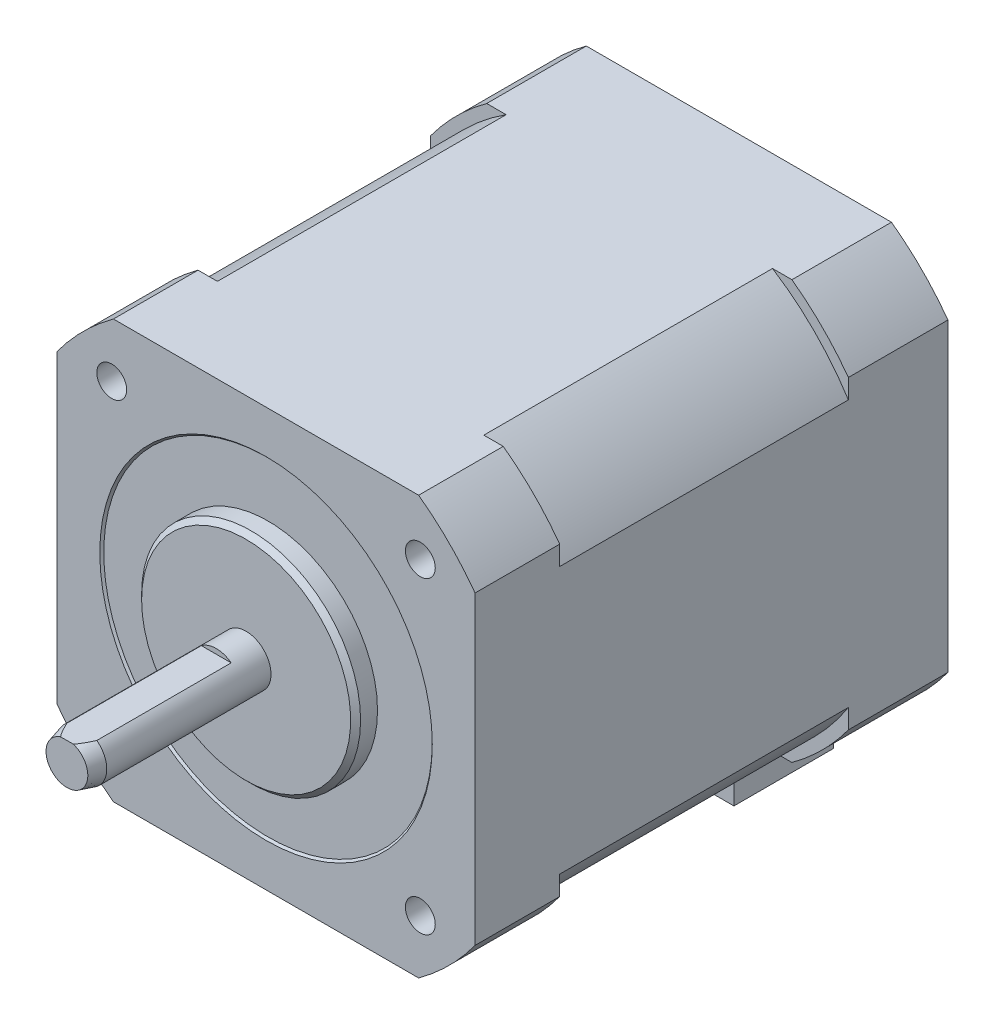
ISO-10303-21;
HEADER;
FILE_DESCRIPTION(('STEP AP214'),'2;1');
FILE_NAME('part.step','',(''),(''),'','','');
FILE_SCHEMA(('AUTOMOTIVE_DESIGN { 1 0 10303 214 1 1 1 1 }'));
ENDSEC;
DATA;
#1=APPLICATION_CONTEXT('core data for automotive mechanical design processes');
#2=APPLICATION_PROTOCOL_DEFINITION('international standard','automotive_design',2000,#1);
#3=PRODUCT_CONTEXT('',#1,'mechanical');
#4=PRODUCT('Part','Part','',(#3));
#5=PRODUCT_RELATED_PRODUCT_CATEGORY('part','',(#4));
#6=PRODUCT_DEFINITION_FORMATION('','',#4);
#7=PRODUCT_DEFINITION_CONTEXT('part definition',#1,'design');
#8=PRODUCT_DEFINITION('design','',#6,#7);
#9=PRODUCT_DEFINITION_SHAPE('','',#8);
#10=(LENGTH_UNIT() NAMED_UNIT(*) SI_UNIT(.MILLI.,.METRE.));
#11=(NAMED_UNIT(*) PLANE_ANGLE_UNIT() SI_UNIT($,.RADIAN.));
#12=(NAMED_UNIT(*) SI_UNIT($,.STERADIAN.) SOLID_ANGLE_UNIT());
#13=UNCERTAINTY_MEASURE_WITH_UNIT(LENGTH_MEASURE(1.E-05),#10,'distance_accuracy_value','');
#14=(GEOMETRIC_REPRESENTATION_CONTEXT(3) GLOBAL_UNCERTAINTY_ASSIGNED_CONTEXT((#13)) GLOBAL_UNIT_ASSIGNED_CONTEXT((#10,
#11,#12)) REPRESENTATION_CONTEXT('',''));
#15=CARTESIAN_POINT('',(0.,0.,0.));
#16=DIRECTION('',(0.,0.,1.));
#17=DIRECTION('',(1.,0.,0.));
#18=AXIS2_PLACEMENT_3D('',#15,#16,#17);
#19=CARTESIAN_POINT('',(21.,-21.,-10.5));
#20=DIRECTION('',(0.,1.,0.));
#21=DIRECTION('',(-1.,0.,0.));
#22=AXIS2_PLACEMENT_3D('',#19,#20,#21);
#23=PLANE('',#22);
#24=DIRECTION('',(0.,0.,-1.));
#25=VECTOR('',#24,1.);
#26=CARTESIAN_POINT('',(-9.5,-21.,-39.5));
#27=LINE('',#26,#25);
#28=CARTESIAN_POINT('',(-9.5,-21.,-39.5));
#29=VERTEX_POINT('',#28);
#30=CARTESIAN_POINT('',(-9.5,-21.0000000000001,-49.5));
#31=VERTEX_POINT('',#30);
#32=EDGE_CURVE('E42',#29,#31,#27,.T.);
#33=ORIENTED_EDGE('',*,*,#32,.F.);
#34=DIRECTION('',(-1.,0.,0.));
#35=VECTOR('',#34,1.);
#36=CARTESIAN_POINT('',(-9.5,-21.,-39.5));
#37=LINE('',#36,#35);
#38=CARTESIAN_POINT('',(9.5,-21.,-39.5));
#39=VERTEX_POINT('',#38);
#40=EDGE_CURVE('E262',#39,#29,#37,.T.);
#41=ORIENTED_EDGE('',*,*,#40,.F.);
#42=DIRECTION('',(0.,0.,1.));
#43=VECTOR('',#42,1.);
#44=CARTESIAN_POINT('',(9.5,-21.,-39.5));
#45=LINE('',#44,#43);
#46=CARTESIAN_POINT('',(9.5,-21.,-49.5));
#47=VERTEX_POINT('',#46);
#48=EDGE_CURVE('E278',#47,#39,#45,.T.);
#49=ORIENTED_EDGE('',*,*,#48,.F.);
#50=DIRECTION('',(-1.,0.,0.));
#51=VECTOR('',#50,1.);
#52=CARTESIAN_POINT('',(15.3297097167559,-21.,-49.5));
#53=LINE('',#52,#51);
#54=CARTESIAN_POINT('',(15.3297097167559,-21.,-49.5));
#55=VERTEX_POINT('',#54);
#56=EDGE_CURVE('E283',#55,#47,#53,.T.);
#57=ORIENTED_EDGE('',*,*,#56,.F.);
#58=DIRECTION('',(0.,0.,1.));
#59=VECTOR('',#58,1.);
#60=CARTESIAN_POINT('',(15.3297097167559,-21.,-49.5));
#61=LINE('',#60,#59);
#62=CARTESIAN_POINT('',(15.3297097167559,-21.,-39.5));
#63=VERTEX_POINT('',#62);
#64=EDGE_CURVE('E356',#55,#63,#61,.T.);
#65=ORIENTED_EDGE('',*,*,#64,.T.);
#66=DIRECTION('',(-1.,0.,0.));
#67=VECTOR('',#66,1.);
#68=CARTESIAN_POINT('',(-13.3794618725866,-21.,-39.5));
#69=LINE('',#68,#67);
#70=CARTESIAN_POINT('',(13.3794618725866,-21.,-39.5));
#71=VERTEX_POINT('',#70);
#72=EDGE_CURVE('E317',#63,#71,#69,.T.);
#73=ORIENTED_EDGE('',*,*,#72,.T.);
#74=DIRECTION('',(0.,0.,1.));
#75=VECTOR('',#74,1.);
#76=CARTESIAN_POINT('',(13.3794618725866,-21.,-39.5));
#77=LINE('',#76,#75);
#78=CARTESIAN_POINT('',(13.3794618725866,-21.,-10.5));
#79=VERTEX_POINT('',#78);
#80=EDGE_CURVE('E724',#71,#79,#77,.T.);
#81=ORIENTED_EDGE('',*,*,#80,.T.);
#82=DIRECTION('',(-1.,0.,0.));
#83=VECTOR('',#82,1.);
#84=CARTESIAN_POINT('',(21.,-21.,-10.5));
#85=LINE('',#84,#83);
#86=CARTESIAN_POINT('',(15.3297097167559,-21.,-10.5));
#87=VERTEX_POINT('',#86);
#88=EDGE_CURVE('E563',#87,#79,#85,.T.);
#89=ORIENTED_EDGE('',*,*,#88,.F.);
#90=DIRECTION('',(0.,0.,1.));
#91=VECTOR('',#90,1.);
#92=CARTESIAN_POINT('',(15.3297097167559,-21.,-36.));
#93=LINE('',#92,#91);
#94=CARTESIAN_POINT('',(15.3297097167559,-21.,-2.));
#95=VERTEX_POINT('',#94);
#96=EDGE_CURVE('E625',#95,#87,#93,.F.);
#97=ORIENTED_EDGE('',*,*,#96,.F.);
#98=DIRECTION('',(-1.,0.,0.));
#99=VECTOR('',#98,1.);
#100=CARTESIAN_POINT('',(21.,-21.,-2.));
#101=LINE('',#100,#99);
#102=CARTESIAN_POINT('',(-15.3297097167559,-21.,-2.));
#103=VERTEX_POINT('',#102);
#104=EDGE_CURVE('E571',#95,#103,#101,.T.);
#105=ORIENTED_EDGE('',*,*,#104,.T.);
#106=DIRECTION('',(0.,0.,1.));
#107=VECTOR('',#106,1.);
#108=CARTESIAN_POINT('',(-15.3297097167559,-21.,-36.));
#109=LINE('',#108,#107);
#110=CARTESIAN_POINT('',(-15.3297097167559,-21.,-10.5));
#111=VERTEX_POINT('',#110);
#112=EDGE_CURVE('E629',#111,#103,#109,.T.);
#113=ORIENTED_EDGE('',*,*,#112,.F.);
#114=CARTESIAN_POINT('',(-13.3794618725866,-21.,-10.5));
#115=VERTEX_POINT('',#114);
#116=EDGE_CURVE('E568',#115,#111,#85,.T.);
#117=ORIENTED_EDGE('',*,*,#116,.F.);
#118=DIRECTION('',(0.,0.,1.));
#119=VECTOR('',#118,1.);
#120=CARTESIAN_POINT('',(-13.3794618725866,-21.,-39.5));
#121=LINE('',#120,#119);
#122=CARTESIAN_POINT('',(-13.3794618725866,-21.,-39.5));
#123=VERTEX_POINT('',#122);
#124=EDGE_CURVE('E725',#123,#115,#121,.T.);
#125=ORIENTED_EDGE('',*,*,#124,.F.);
#126=CARTESIAN_POINT('',(-15.3297097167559,-21.,-39.5));
#127=VERTEX_POINT('',#126);
#128=EDGE_CURVE('E315',#123,#127,#69,.T.);
#129=ORIENTED_EDGE('',*,*,#128,.T.);
#130=DIRECTION('',(0.,0.,1.));
#131=VECTOR('',#130,1.);
#132=CARTESIAN_POINT('',(-15.3297097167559,-21.,-49.5));
#133=LINE('',#132,#131);
#134=CARTESIAN_POINT('',(-15.3297097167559,-21.,-49.5));
#135=VERTEX_POINT('',#134);
#136=EDGE_CURVE('E353',#135,#127,#133,.T.);
#137=ORIENTED_EDGE('',*,*,#136,.F.);
#138=EDGE_CURVE('E60',#31,#135,#53,.T.);
#139=ORIENTED_EDGE('',*,*,#138,.F.);
#140=EDGE_LOOP('',(#33,#41,#49,#57,#65,#73,#81,#89,#97,#105,#113,#117,#125,#129,#137,#139));
#141=FACE_BOUND('',#140,.T.);
#142=ADVANCED_FACE('F38',(#141),#23,.F.);
#143=CARTESIAN_POINT('',(0.,0.,18.));
#144=DIRECTION('',(0.,0.,-1.));
#145=DIRECTION('',(-1.,0.,0.));
#146=AXIS2_PLACEMENT_3D('',#143,#144,#145);
#147=CYLINDRICAL_SURFACE('',#146,2.5);
#148=CARTESIAN_POINT('',(0.,0.,16.5000000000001));
#149=DIRECTION('',(0.,0.,1.));
#150=DIRECTION('',(1.,0.,0.));
#151=AXIS2_PLACEMENT_3D('',#148,#149,#150);
#152=CIRCLE('',#151,2.5);
#153=CARTESIAN_POINT('',(1.5,2.,16.5000000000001));
#154=VERTEX_POINT('',#153);
#155=CARTESIAN_POINT('',(-1.49999999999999,2.,16.5000000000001));
#156=VERTEX_POINT('',#155);
#157=EDGE_CURVE('E407',#154,#156,#152,.F.);
#158=ORIENTED_EDGE('',*,*,#157,.T.);
#159=DIRECTION('',(0.,0.,-1.));
#160=VECTOR('',#159,1.);
#161=CARTESIAN_POINT('',(-1.5,2.,18.));
#162=LINE('',#161,#160);
#163=CARTESIAN_POINT('',(-1.5,2.,3.));
#164=VERTEX_POINT('',#163);
#165=EDGE_CURVE('E303',#156,#164,#162,.T.);
#166=ORIENTED_EDGE('',*,*,#165,.T.);
#167=CARTESIAN_POINT('',(0.,0.,3.));
#168=DIRECTION('',(0.,0.,1.));
#169=DIRECTION('',(1.,0.,0.));
#170=AXIS2_PLACEMENT_3D('',#167,#168,#169);
#171=CIRCLE('',#170,2.5);
#172=CARTESIAN_POINT('',(1.5,2.,3.));
#173=VERTEX_POINT('',#172);
#174=EDGE_CURVE('E419',#173,#164,#171,.T.);
#175=ORIENTED_EDGE('',*,*,#174,.F.);
#176=DIRECTION('',(0.,0.,-1.));
#177=VECTOR('',#176,1.);
#178=CARTESIAN_POINT('',(1.5,2.,18.));
#179=LINE('',#178,#177);
#180=EDGE_CURVE('E756',#173,#154,#179,.F.);
#181=ORIENTED_EDGE('',*,*,#180,.T.);
#182=EDGE_LOOP('',(#158,#166,#175,#181));
#183=FACE_BOUND('',#182,.T.);
#184=CARTESIAN_POINT('',(0.,0.,0.));
#185=DIRECTION('',(0.,0.,-1.));
#186=DIRECTION('',(-1.,0.,0.));
#187=AXIS2_PLACEMENT_3D('',#184,#185,#186);
#188=CIRCLE('',#187,2.5);
#189=CARTESIAN_POINT('',(-2.5,0.,0.));
#190=VERTEX_POINT('',#189);
#191=EDGE_CURVE('E560',#190,#190,#188,.T.);
#192=ORIENTED_EDGE('',*,*,#191,.F.);
#193=EDGE_LOOP('',(#192));
#194=FACE_BOUND('',#193,.T.);
#195=ADVANCED_FACE('F528',(#183,#194),#147,.T.);
#196=CARTESIAN_POINT('',(0.,0.,18.));
#197=DIRECTION('',(0.,0.,1.));
#198=DIRECTION('',(1.,0.,0.));
#199=AXIS2_PLACEMENT_3D('',#196,#197,#198);
#200=PLANE('',#199);
#201=DIRECTION('',(1.,0.,0.));
#202=VECTOR('',#201,1.);
#203=CARTESIAN_POINT('',(-4.72781232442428,2.,18.));
#204=LINE('',#203,#202);
#205=CARTESIAN_POINT('',(-0.633974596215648,2.,18.));
#206=VERTEX_POINT('',#205);
#207=CARTESIAN_POINT('',(0.633974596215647,2.,18.));
#208=VERTEX_POINT('',#207);
#209=EDGE_CURVE('E759',#206,#208,#204,.T.);
#210=ORIENTED_EDGE('',*,*,#209,.F.);
#211=CARTESIAN_POINT('',(0.,0.,18.));
#212=DIRECTION('',(0.,0.,1.));
#213=DIRECTION('',(1.,0.,0.));
#214=AXIS2_PLACEMENT_3D('',#211,#212,#213);
#215=CIRCLE('',#214,2.09807621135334);
#216=EDGE_CURVE('E404',#206,#208,#215,.T.);
#217=ORIENTED_EDGE('',*,*,#216,.T.);
#218=EDGE_LOOP('',(#210,#217));
#219=FACE_BOUND('',#218,.T.);
#220=ADVANCED_FACE('F543',(#219),#200,.T.);
#221=CARTESIAN_POINT('',(0.,0.,0.));
#222=DIRECTION('',(0.,0.,-1.));
#223=DIRECTION('',(-1.,0.,0.));
#224=AXIS2_PLACEMENT_3D('',#221,#222,#223);
#225=PLANE('',#224);
#226=CARTESIAN_POINT('',(0.,0.,0.));
#227=DIRECTION('',(0.,0.,-1.));
#228=DIRECTION('',(-1.,0.,0.));
#229=AXIS2_PLACEMENT_3D('',#226,#227,#228);
#230=CIRCLE('',#229,10.5);
#231=CARTESIAN_POINT('',(-10.5,0.,0.));
#232=VERTEX_POINT('',#231);
#233=EDGE_CURVE('E48',#232,#232,#230,.F.);
#234=ORIENTED_EDGE('',*,*,#233,.T.);
#235=EDGE_LOOP('',(#234));
#236=FACE_BOUND('',#235,.T.);
#237=ORIENTED_EDGE('',*,*,#191,.T.);
#238=EDGE_LOOP('',(#237));
#239=FACE_BOUND('',#238,.T.);
#240=ADVANCED_FACE('F539',(#236,#239),#225,.F.);
#241=CARTESIAN_POINT('',(0.,0.,-2.));
#242=DIRECTION('',(0.,0.,1.));
#243=DIRECTION('',(1.,0.,0.));
#244=AXIS2_PLACEMENT_3D('',#241,#242,#243);
#245=CYLINDRICAL_SURFACE('',#244,11.);
#246=CARTESIAN_POINT('',(0.,0.,-0.500000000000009));
#247=DIRECTION('',(0.,0.,-1.));
#248=DIRECTION('',(-1.,0.,0.));
#249=AXIS2_PLACEMENT_3D('',#246,#247,#248);
#250=CIRCLE('',#249,11.);
#251=CARTESIAN_POINT('',(-11.,0.,-0.500000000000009));
#252=VERTEX_POINT('',#251);
#253=EDGE_CURVE('E825',#252,#252,#250,.T.);
#254=ORIENTED_EDGE('',*,*,#253,.T.);
#255=EDGE_LOOP('',(#254));
#256=FACE_BOUND('',#255,.T.);
#257=CARTESIAN_POINT('',(0.,0.,-2.2));
#258=DIRECTION('',(0.,0.,1.));
#259=DIRECTION('',(1.,0.,0.));
#260=AXIS2_PLACEMENT_3D('',#257,#258,#259);
#261=CIRCLE('',#260,11.);
#262=CARTESIAN_POINT('',(11.,0.,-2.2));
#263=VERTEX_POINT('',#262);
#264=EDGE_CURVE('E265',#263,#263,#261,.T.);
#265=ORIENTED_EDGE('',*,*,#264,.T.);
#266=EDGE_LOOP('',(#265));
#267=FACE_BOUND('',#266,.T.);
#268=ADVANCED_FACE('F542',(#256,#267),#245,.T.);
#269=CARTESIAN_POINT('',(0.,0.,18.));
#270=DIRECTION('',(0.,0.,-1.));
#271=DIRECTION('',(-1.,0.,0.));
#272=AXIS2_PLACEMENT_3D('',#269,#270,#271);
#273=CONICAL_SURFACE('',#272,2.09807621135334,0.261799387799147);
#274=CARTESIAN_POINT('',(-2.67411513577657,2.,13.3677080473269));
#275=CARTESIAN_POINT('',(-2.63311786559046,2.,13.4902257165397));
#276=CARTESIAN_POINT('',(-2.59182160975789,2.,13.6126436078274));
#277=CARTESIAN_POINT('',(-2.50853023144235,2.,13.8572444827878));
#278=CARTESIAN_POINT('',(-2.46653509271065,2.,13.9794274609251));
#279=CARTESIAN_POINT('',(-2.33928264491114,2.,14.3457646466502));
#280=CARTESIAN_POINT('',(-2.25282589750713,2.,14.5895039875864));
#281=CARTESIAN_POINT('',(-2.07457613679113,2.,15.0781045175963));
#282=CARTESIAN_POINT('',(-1.98273458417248,2.,15.3229481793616));
#283=CARTESIAN_POINT('',(-1.84011140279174,2.,15.6882620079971));
#284=CARTESIAN_POINT('',(-1.79177038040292,2.,15.8096838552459));
#285=CARTESIAN_POINT('',(-1.69305456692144,2.,16.0516959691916));
#286=CARTESIAN_POINT('',(-1.64267985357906,2.,16.1722862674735));
#287=CARTESIAN_POINT('',(-1.53950262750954,2.,16.4120087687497));
#288=CARTESIAN_POINT('',(-1.48670769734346,2.,16.5311442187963));
#289=CARTESIAN_POINT('',(-1.37773401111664,2.,16.7679408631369));
#290=CARTESIAN_POINT('',(-1.32155357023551,2.,16.8856012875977));
#291=CARTESIAN_POINT('',(-1.20458285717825,2.,17.1187131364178));
#292=CARTESIAN_POINT('',(-1.14379017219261,2.,17.2341633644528));
#293=CARTESIAN_POINT('',(-1.01570284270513,2.,17.4612984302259));
#294=CARTESIAN_POINT('',(-0.948415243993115,2.,17.5729871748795));
#295=CARTESIAN_POINT('',(-0.817363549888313,2.,17.7692701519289));
#296=CARTESIAN_POINT('',(-0.755348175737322,2.,17.8549879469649));
#297=CARTESIAN_POINT('',(-0.654778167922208,2.,17.9770588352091));
#298=CARTESIAN_POINT('',(-0.620094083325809,2.,18.0165731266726));
#299=CARTESIAN_POINT('',(-0.547506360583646,2.,18.0924930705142));
#300=CARTESIAN_POINT('',(-0.509607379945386,2.,18.128903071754));
#301=CARTESIAN_POINT('',(-0.439829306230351,2.,18.1884315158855));
#302=CARTESIAN_POINT('',(-0.40884422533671,2.,18.2125855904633));
#303=CARTESIAN_POINT('',(-0.344218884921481,2.,18.2572111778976));
#304=CARTESIAN_POINT('',(-0.310575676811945,2.,18.2776785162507));
#305=CARTESIAN_POINT('',(-0.240012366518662,2.,18.3136158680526));
#306=CARTESIAN_POINT('',(-0.203051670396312,2.,18.3290087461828));
#307=CARTESIAN_POINT('',(-0.126881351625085,2.,18.3523462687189));
#308=CARTESIAN_POINT('',(-0.0876800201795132,2.,18.3603166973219));
#309=CARTESIAN_POINT('',(-0.0127311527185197,2.,18.3670397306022));
#310=CARTESIAN_POINT('',(0.0229341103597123,2.,18.3666919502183));
#311=CARTESIAN_POINT('',(0.0935290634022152,2.,18.3590326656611));
#312=CARTESIAN_POINT('',(0.128457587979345,2.,18.351710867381));
#313=CARTESIAN_POINT('',(0.201815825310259,2.,18.3295534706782));
#314=CARTESIAN_POINT('',(0.239935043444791,2.,18.3137192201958));
#315=CARTESIAN_POINT('',(0.313185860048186,2.,18.2762831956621));
#316=CARTESIAN_POINT('',(0.348311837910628,2.,18.2546708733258));
#317=CARTESIAN_POINT('',(0.443923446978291,2.,18.1877621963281));
#318=CARTESIAN_POINT('',(0.501075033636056,2.,18.1377652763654));
#319=CARTESIAN_POINT('',(0.581429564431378,2.,18.0575943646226));
#320=CARTESIAN_POINT('',(0.607372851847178,2.,18.0299378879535));
#321=CARTESIAN_POINT('',(0.657731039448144,2.,17.9732675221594));
#322=CARTESIAN_POINT('',(0.68214664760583,2.,17.9442542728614));
#323=CARTESIAN_POINT('',(0.749893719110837,2.,17.8601101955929));
#324=CARTESIAN_POINT('',(0.791668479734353,2.,17.8037362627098));
#325=CARTESIAN_POINT('',(0.8719398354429,2.,17.6886841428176));
#326=CARTESIAN_POINT('',(0.91043426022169,2.,17.6300044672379));
#327=CARTESIAN_POINT('',(0.984949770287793,2.,17.5109259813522));
#328=CARTESIAN_POINT('',(1.02096523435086,2.,17.4505236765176));
#329=CARTESIAN_POINT('',(1.09096213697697,2.,17.3285472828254));
#330=CARTESIAN_POINT('',(1.12494324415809,2.,17.2669730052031));
#331=CARTESIAN_POINT('',(1.22495399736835,2.,17.0799665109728));
#332=CARTESIAN_POINT('',(1.28847862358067,2.,16.9531970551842));
#333=CARTESIAN_POINT('',(1.41085483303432,2.,16.6976781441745));
#334=CARTESIAN_POINT('',(1.46971282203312,2.,16.5689317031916));
#335=CARTESIAN_POINT('',(1.58310001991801,2.,16.3121463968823));
#336=CARTESIAN_POINT('',(1.63768554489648,2.,16.1841322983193));
#337=CARTESIAN_POINT('',(1.74436311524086,2.,15.9270663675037));
#338=CARTESIAN_POINT('',(1.7964550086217,2.,15.7980144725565));
#339=CARTESIAN_POINT('',(1.94989108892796,2.,15.4094944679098));
#340=CARTESIAN_POINT('',(2.04830566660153,2.,15.1488712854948));
#341=CARTESIAN_POINT('',(2.23648040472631,2.,14.6352664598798));
#342=CARTESIAN_POINT('',(2.32642514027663,2.,14.3823515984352));
#343=CARTESIAN_POINT('',(2.45867006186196,2.,14.0022493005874));
#344=CARTESIAN_POINT('',(2.50227709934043,2.,13.875514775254));
#345=CARTESIAN_POINT('',(2.58873482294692,2.,13.6217918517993));
#346=CARTESIAN_POINT('',(2.63158553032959,2.,13.4948034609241));
#347=CARTESIAN_POINT('',(2.67411513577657,2.,13.3677080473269));
#348=B_SPLINE_CURVE_WITH_KNOTS('',3,(#274,#275,#276,#277,#278,#279,#280,#281,#282,#283,#284,
#285,#286,#287,#288,#289,#290,#291,#292,#293,#294,#295,#296,#297,#298,#299,#300,#301,#302,#303,
#304,#305,#306,#307,#308,#309,#310,#311,#312,#313,#314,#315,#316,#317,#318,#319,#320,#321,#322,
#323,#324,#325,#326,#327,#328,#329,#330,#331,#332,#333,#334,#335,#336,#337,#338,#339,#340,#341,
#342,#343,#344,#345,#346,#347),.UNSPECIFIED.,.F.,.F.,(4,2,2,2,2,2,2,2,2,2,2,2,2,2,2,2,2,2,2,2,2,
2,2,2,2,2,2,2,2,2,2,2,2,2,2,2,4),(0.,0.387584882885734,0.775178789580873,1.55100876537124,
2.33544116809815,2.72750017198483,3.11954420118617,3.51043426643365,3.90152049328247,
4.29281273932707,4.68368517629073,5.00048531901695,5.15809093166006,5.31547199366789,
5.43314149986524,5.55094341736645,5.67046127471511,5.78956238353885,5.89584731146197,
6.00228936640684,6.12543181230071,6.24880061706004,6.47525140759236,6.58900607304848,
6.70270762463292,6.91302983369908,7.1234901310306,7.33441292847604,7.54536999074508,
7.97059745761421,8.39523074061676,8.81269313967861,9.23018095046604,10.0658395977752,
10.8711084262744,11.2731870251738,11.6752543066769),.UNSPECIFIED.);
#349=EDGE_CURVE('E418',#156,#206,#348,.T.);
#350=ORIENTED_EDGE('',*,*,#349,.F.);
#351=ORIENTED_EDGE('',*,*,#157,.F.);
#352=EDGE_CURVE('E411',#208,#154,#348,.T.);
#353=ORIENTED_EDGE('',*,*,#352,.F.);
#354=ORIENTED_EDGE('',*,*,#216,.F.);
#355=EDGE_LOOP('',(#350,#351,#353,#354));
#356=FACE_BOUND('',#355,.T.);
#357=ADVANCED_FACE('F421',(#356),#273,.T.);
#358=CARTESIAN_POINT('',(0.,0.,3.));
#359=DIRECTION('',(0.,0.,1.));
#360=DIRECTION('',(1.,0.,0.));
#361=AXIS2_PLACEMENT_3D('',#358,#359,#360);
#362=PLANE('',#361);
#363=ORIENTED_EDGE('',*,*,#174,.T.);
#364=DIRECTION('',(1.,0.,0.));
#365=VECTOR('',#364,1.);
#366=CARTESIAN_POINT('',(-4.72781232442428,2.,3.));
#367=LINE('',#366,#365);
#368=EDGE_CURVE('E758',#164,#173,#367,.T.);
#369=ORIENTED_EDGE('',*,*,#368,.T.);
#370=EDGE_LOOP('',(#363,#369));
#371=FACE_BOUND('',#370,.T.);
#372=ADVANCED_FACE('F430',(#371),#362,.T.);
#373=CARTESIAN_POINT('',(-4.72781232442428,2.,3.));
#374=DIRECTION('',(0.,-1.,0.));
#375=DIRECTION('',(0.,0.,-1.));
#376=AXIS2_PLACEMENT_3D('',#373,#374,#375);
#377=PLANE('',#376);
#378=ORIENTED_EDGE('',*,*,#349,.T.);
#379=ORIENTED_EDGE('',*,*,#209,.T.);
#380=ORIENTED_EDGE('',*,*,#352,.T.);
#381=ORIENTED_EDGE('',*,*,#180,.F.);
#382=ORIENTED_EDGE('',*,*,#368,.F.);
#383=ORIENTED_EDGE('',*,*,#165,.F.);
#384=EDGE_LOOP('',(#378,#379,#380,#381,#382,#383));
#385=FACE_BOUND('',#384,.T.);
#386=ADVANCED_FACE('F424',(#385),#377,.F.);
#387=CARTESIAN_POINT('',(0.,0.,-2.2));
#388=DIRECTION('',(0.,0.,1.));
#389=DIRECTION('',(1.,0.,0.));
#390=AXIS2_PLACEMENT_3D('',#387,#388,#389);
#391=PLANE('',#390);
#392=ORIENTED_EDGE('',*,*,#264,.F.);
#393=EDGE_LOOP('',(#392));
#394=FACE_BOUND('',#393,.T.);
#395=CARTESIAN_POINT('',(0.,0.,-2.2));
#396=DIRECTION('',(0.,0.,1.));
#397=DIRECTION('',(1.,0.,0.));
#398=AXIS2_PLACEMENT_3D('',#395,#396,#397);
#399=CIRCLE('',#398,16.5);
#400=CARTESIAN_POINT('',(16.5,0.,-2.2));
#401=VERTEX_POINT('',#400);
#402=EDGE_CURVE('E268',#401,#401,#399,.T.);
#403=ORIENTED_EDGE('',*,*,#402,.T.);
#404=EDGE_LOOP('',(#403));
#405=FACE_BOUND('',#404,.T.);
#406=ADVANCED_FACE('F429',(#394,#405),#391,.T.);
#407=CARTESIAN_POINT('',(-21.,-21.,-10.5));
#408=DIRECTION('',(0.,0.,-1.));
#409=DIRECTION('',(-1.,0.,0.));
#410=AXIS2_PLACEMENT_3D('',#407,#408,#409);
#411=PLANE('',#410);
#412=CARTESIAN_POINT('',(0.,0.,-10.5));
#413=DIRECTION('',(0.,0.,-1.));
#414=DIRECTION('',(-1.,0.,0.));
#415=AXIS2_PLACEMENT_3D('',#412,#413,#414);
#416=CIRCLE('',#415,24.9);
#417=CARTESIAN_POINT('',(13.3794618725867,21.,-10.5));
#418=VERTEX_POINT('',#417);
#419=CARTESIAN_POINT('',(21.,13.3794618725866,-10.5));
#420=VERTEX_POINT('',#419);
#421=EDGE_CURVE('E402',#418,#420,#416,.T.);
#422=ORIENTED_EDGE('',*,*,#421,.F.);
#423=DIRECTION('',(1.,0.,0.));
#424=VECTOR('',#423,1.);
#425=CARTESIAN_POINT('',(21.,21.,-10.5));
#426=LINE('',#425,#424);
#427=CARTESIAN_POINT('',(15.3297097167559,21.,-10.5));
#428=VERTEX_POINT('',#427);
#429=EDGE_CURVE('E577',#418,#428,#426,.T.);
#430=ORIENTED_EDGE('',*,*,#429,.T.);
#431=CARTESIAN_POINT('',(0.,0.,-10.5));
#432=DIRECTION('',(0.,0.,-1.));
#433=DIRECTION('',(-1.,0.,0.));
#434=AXIS2_PLACEMENT_3D('',#431,#432,#433);
#435=CIRCLE('',#434,26.);
#436=CARTESIAN_POINT('',(21.,15.3297097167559,-10.5));
#437=VERTEX_POINT('',#436);
#438=EDGE_CURVE('E605',#428,#437,#435,.T.);
#439=ORIENTED_EDGE('',*,*,#438,.T.);
#440=DIRECTION('',(0.,-1.,0.));
#441=VECTOR('',#440,1.);
#442=CARTESIAN_POINT('',(21.,21.,-10.5));
#443=LINE('',#442,#441);
#444=EDGE_CURVE('E599',#437,#420,#443,.T.);
#445=ORIENTED_EDGE('',*,*,#444,.T.);
#446=EDGE_LOOP('',(#422,#430,#439,#445));
#447=FACE_BOUND('',#446,.T.);
#448=ADVANCED_FACE('F500',(#447),#411,.T.);
#449=CARTESIAN_POINT('',(0.,0.,-39.5));
#450=DIRECTION('',(0.,0.,1.));
#451=DIRECTION('',(1.,0.,0.));
#452=AXIS2_PLACEMENT_3D('',#449,#450,#451);
#453=CYLINDRICAL_SURFACE('',#452,24.9);
#454=ORIENTED_EDGE('',*,*,#421,.T.);
#455=DIRECTION('',(0.,0.,1.));
#456=VECTOR('',#455,1.);
#457=CARTESIAN_POINT('',(21.,13.3794618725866,-39.5));
#458=LINE('',#457,#456);
#459=CARTESIAN_POINT('',(21.0000000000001,13.3794618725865,-39.5));
#460=VERTEX_POINT('',#459);
#461=EDGE_CURVE('E645',#460,#420,#458,.T.);
#462=ORIENTED_EDGE('',*,*,#461,.F.);
#463=CARTESIAN_POINT('',(0.,0.,-39.5));
#464=DIRECTION('',(0.,0.,-1.));
#465=DIRECTION('',(-1.,0.,0.));
#466=AXIS2_PLACEMENT_3D('',#463,#464,#465);
#467=CIRCLE('',#466,24.9);
#468=CARTESIAN_POINT('',(13.3794618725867,21.,-39.5));
#469=VERTEX_POINT('',#468);
#470=EDGE_CURVE('E668',#469,#460,#467,.T.);
#471=ORIENTED_EDGE('',*,*,#470,.F.);
#472=DIRECTION('',(0.,0.,1.));
#473=VECTOR('',#472,1.);
#474=CARTESIAN_POINT('',(13.3794618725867,21.,-39.5));
#475=LINE('',#474,#473);
#476=EDGE_CURVE('E648',#469,#418,#475,.T.);
#477=ORIENTED_EDGE('',*,*,#476,.T.);
#478=EDGE_LOOP('',(#454,#462,#471,#477));
#479=FACE_BOUND('',#478,.T.);
#480=ADVANCED_FACE('F497',(#479),#453,.T.);
#481=CARTESIAN_POINT('',(0.,0.,-39.5));
#482=DIRECTION('',(0.,0.,-1.));
#483=DIRECTION('',(-1.,0.,0.));
#484=AXIS2_PLACEMENT_3D('',#481,#482,#483);
#485=PLANE('',#484);
#486=DIRECTION('',(1.,0.,0.));
#487=VECTOR('',#486,1.);
#488=CARTESIAN_POINT('',(13.3794618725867,21.,-39.5));
#489=LINE('',#488,#487);
#490=CARTESIAN_POINT('',(15.3297097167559,21.,-39.5));
#491=VERTEX_POINT('',#490);
#492=EDGE_CURVE('E335',#469,#491,#489,.T.);
#493=ORIENTED_EDGE('',*,*,#492,.F.);
#494=ORIENTED_EDGE('',*,*,#470,.T.);
#495=DIRECTION('',(0.,-1.,0.));
#496=VECTOR('',#495,1.);
#497=CARTESIAN_POINT('',(21.,-13.3794618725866,-39.5));
#498=LINE('',#497,#496);
#499=CARTESIAN_POINT('',(21.,15.3297097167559,-39.5));
#500=VERTEX_POINT('',#499);
#501=EDGE_CURVE('E312',#500,#460,#498,.T.);
#502=ORIENTED_EDGE('',*,*,#501,.F.);
#503=CARTESIAN_POINT('',(0.,0.,-39.5));
#504=DIRECTION('',(0.,0.,-1.));
#505=DIRECTION('',(-1.,0.,0.));
#506=AXIS2_PLACEMENT_3D('',#503,#504,#505);
#507=CIRCLE('',#506,26.);
#508=EDGE_CURVE('E299',#491,#500,#507,.T.);
#509=ORIENTED_EDGE('',*,*,#508,.F.);
#510=EDGE_LOOP('',(#493,#494,#502,#509));
#511=FACE_BOUND('',#510,.T.);
#512=ADVANCED_FACE('F444',(#511),#485,.F.);
#513=CARTESIAN_POINT('',(0.,0.,-49.5));
#514=DIRECTION('',(0.,0.,1.));
#515=DIRECTION('',(1.,0.,0.));
#516=AXIS2_PLACEMENT_3D('',#513,#514,#515);
#517=CYLINDRICAL_SURFACE('',#516,26.);
#518=ORIENTED_EDGE('',*,*,#508,.T.);
#519=DIRECTION('',(0.,0.,1.));
#520=VECTOR('',#519,1.);
#521=CARTESIAN_POINT('',(21.,15.3297097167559,-49.5));
#522=LINE('',#521,#520);
#523=CARTESIAN_POINT('',(21.,15.3297097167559,-49.5));
#524=VERTEX_POINT('',#523);
#525=EDGE_CURVE('E361',#524,#500,#522,.T.);
#526=ORIENTED_EDGE('',*,*,#525,.F.);
#527=CARTESIAN_POINT('',(0.,0.,-49.5));
#528=DIRECTION('',(0.,0.,-1.));
#529=DIRECTION('',(-1.,0.,0.));
#530=AXIS2_PLACEMENT_3D('',#527,#528,#529);
#531=CIRCLE('',#530,26.);
#532=CARTESIAN_POINT('',(15.3297097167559,21.,-49.5));
#533=VERTEX_POINT('',#532);
#534=EDGE_CURVE('E750',#533,#524,#531,.T.);
#535=ORIENTED_EDGE('',*,*,#534,.F.);
#536=DIRECTION('',(0.,0.,1.));
#537=VECTOR('',#536,1.);
#538=CARTESIAN_POINT('',(15.3297097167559,21.,-49.5));
#539=LINE('',#538,#537);
#540=EDGE_CURVE('E298',#533,#491,#539,.T.);
#541=ORIENTED_EDGE('',*,*,#540,.T.);
#542=EDGE_LOOP('',(#518,#526,#535,#541));
#543=FACE_BOUND('',#542,.T.);
#544=ADVANCED_FACE('F456',(#543),#517,.T.);
#545=CARTESIAN_POINT('',(0.,0.,-10.5));
#546=DIRECTION('',(0.,0.,-1.));
#547=DIRECTION('',(-1.,0.,0.));
#548=AXIS2_PLACEMENT_3D('',#545,#546,#547);
#549=CIRCLE('',#548,24.9);
#550=CARTESIAN_POINT('',(21.,-13.3794618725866,-10.5));
#551=VERTEX_POINT('',#550);
#552=EDGE_CURVE('E389',#551,#79,#549,.T.);
#553=ORIENTED_EDGE('',*,*,#552,.F.);
#554=CARTESIAN_POINT('',(21.,-15.3297097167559,-10.5));
#555=VERTEX_POINT('',#554);
#556=EDGE_CURVE('E594',#551,#555,#443,.T.);
#557=ORIENTED_EDGE('',*,*,#556,.T.);
#558=EDGE_CURVE('E566',#555,#87,#435,.T.);
#559=ORIENTED_EDGE('',*,*,#558,.T.);
#560=ORIENTED_EDGE('',*,*,#88,.T.);
#561=EDGE_LOOP('',(#553,#557,#559,#560));
#562=FACE_BOUND('',#561,.T.);
#563=ADVANCED_FACE('F459',(#562),#411,.T.);
#564=CARTESIAN_POINT('',(0.,0.,-39.5));
#565=DIRECTION('',(0.,0.,1.));
#566=DIRECTION('',(1.,0.,0.));
#567=AXIS2_PLACEMENT_3D('',#564,#565,#566);
#568=CYLINDRICAL_SURFACE('',#567,24.9);
#569=ORIENTED_EDGE('',*,*,#552,.T.);
#570=ORIENTED_EDGE('',*,*,#80,.F.);
#571=CARTESIAN_POINT('',(0.,0.,-39.5));
#572=DIRECTION('',(0.,0.,-1.));
#573=DIRECTION('',(-1.,0.,0.));
#574=AXIS2_PLACEMENT_3D('',#571,#572,#573);
#575=CIRCLE('',#574,24.9);
#576=CARTESIAN_POINT('',(21.,-13.3794618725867,-39.5));
#577=VERTEX_POINT('',#576);
#578=EDGE_CURVE('E397',#577,#71,#575,.T.);
#579=ORIENTED_EDGE('',*,*,#578,.F.);
#580=DIRECTION('',(0.,0.,1.));
#581=VECTOR('',#580,1.);
#582=CARTESIAN_POINT('',(21.,-13.3794618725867,-39.5));
#583=LINE('',#582,#581);
#584=EDGE_CURVE('E649',#577,#551,#583,.T.);
#585=ORIENTED_EDGE('',*,*,#584,.T.);
#586=EDGE_LOOP('',(#569,#570,#579,#585));
#587=FACE_BOUND('',#586,.T.);
#588=ADVANCED_FACE('F441',(#587),#568,.T.);
#589=CARTESIAN_POINT('',(21.,-15.3297097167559,-39.5));
#590=VERTEX_POINT('',#589);
#591=EDGE_CURVE('E302',#577,#590,#498,.T.);
#592=ORIENTED_EDGE('',*,*,#591,.F.);
#593=ORIENTED_EDGE('',*,*,#578,.T.);
#594=ORIENTED_EDGE('',*,*,#72,.F.);
#595=CARTESIAN_POINT('',(0.,0.,-39.5));
#596=DIRECTION('',(0.,0.,-1.));
#597=DIRECTION('',(-1.,0.,0.));
#598=AXIS2_PLACEMENT_3D('',#595,#596,#597);
#599=CIRCLE('',#598,26.);
#600=EDGE_CURVE('E306',#590,#63,#599,.T.);
#601=ORIENTED_EDGE('',*,*,#600,.F.);
#602=EDGE_LOOP('',(#592,#593,#594,#601));
#603=FACE_BOUND('',#602,.T.);
#604=ADVANCED_FACE('F437',(#603),#485,.F.);
#605=CARTESIAN_POINT('',(0.,0.,-49.5));
#606=DIRECTION('',(0.,0.,1.));
#607=DIRECTION('',(1.,0.,0.));
#608=AXIS2_PLACEMENT_3D('',#605,#606,#607);
#609=CYLINDRICAL_SURFACE('',#608,26.);
#610=ORIENTED_EDGE('',*,*,#600,.T.);
#611=ORIENTED_EDGE('',*,*,#64,.F.);
#612=CARTESIAN_POINT('',(0.,0.,-49.5));
#613=DIRECTION('',(0.,0.,-1.));
#614=DIRECTION('',(-1.,0.,0.));
#615=AXIS2_PLACEMENT_3D('',#612,#613,#614);
#616=CIRCLE('',#615,26.);
#617=CARTESIAN_POINT('',(21.,-15.3297097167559,-49.5));
#618=VERTEX_POINT('',#617);
#619=EDGE_CURVE('E284',#618,#55,#616,.T.);
#620=ORIENTED_EDGE('',*,*,#619,.F.);
#621=DIRECTION('',(0.,0.,1.));
#622=VECTOR('',#621,1.);
#623=CARTESIAN_POINT('',(21.,-15.3297097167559,-49.5));
#624=LINE('',#623,#622);
#625=EDGE_CURVE('E359',#618,#590,#624,.T.);
#626=ORIENTED_EDGE('',*,*,#625,.T.);
#627=EDGE_LOOP('',(#610,#611,#620,#626));
#628=FACE_BOUND('',#627,.T.);
#629=ADVANCED_FACE('F440',(#628),#609,.T.);
#630=CARTESIAN_POINT('',(0.,0.,-10.5));
#631=DIRECTION('',(0.,0.,-1.));
#632=DIRECTION('',(-1.,0.,0.));
#633=AXIS2_PLACEMENT_3D('',#630,#631,#632);
#634=CIRCLE('',#633,24.9);
#635=CARTESIAN_POINT('',(-21.,-13.3794618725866,-10.5));
#636=VERTEX_POINT('',#635);
#637=EDGE_CURVE('E657',#115,#636,#634,.T.);
#638=ORIENTED_EDGE('',*,*,#637,.F.);
#639=ORIENTED_EDGE('',*,*,#116,.T.);
#640=CARTESIAN_POINT('',(-21.,-15.3297097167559,-10.5));
#641=VERTEX_POINT('',#640);
#642=EDGE_CURVE('E562',#111,#641,#435,.T.);
#643=ORIENTED_EDGE('',*,*,#642,.T.);
#644=DIRECTION('',(0.,1.,0.));
#645=VECTOR('',#644,1.);
#646=CARTESIAN_POINT('',(-21.,21.,-10.5));
#647=LINE('',#646,#645);
#648=EDGE_CURVE('E574',#641,#636,#647,.T.);
#649=ORIENTED_EDGE('',*,*,#648,.T.);
#650=EDGE_LOOP('',(#638,#639,#643,#649));
#651=FACE_BOUND('',#650,.T.);
#652=ADVANCED_FACE('F454',(#651),#411,.T.);
#653=CARTESIAN_POINT('',(0.,0.,-39.5));
#654=DIRECTION('',(0.,0.,1.));
#655=DIRECTION('',(1.,0.,0.));
#656=AXIS2_PLACEMENT_3D('',#653,#654,#655);
#657=CYLINDRICAL_SURFACE('',#656,24.9);
#658=ORIENTED_EDGE('',*,*,#637,.T.);
#659=DIRECTION('',(0.,0.,1.));
#660=VECTOR('',#659,1.);
#661=CARTESIAN_POINT('',(-21.,-13.3794618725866,-39.5));
#662=LINE('',#661,#660);
#663=CARTESIAN_POINT('',(-21.,-13.3794618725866,-39.5));
#664=VERTEX_POINT('',#663);
#665=EDGE_CURVE('E665',#664,#636,#662,.T.);
#666=ORIENTED_EDGE('',*,*,#665,.F.);
#667=CARTESIAN_POINT('',(0.,0.,-39.5));
#668=DIRECTION('',(0.,0.,-1.));
#669=DIRECTION('',(-1.,0.,0.));
#670=AXIS2_PLACEMENT_3D('',#667,#668,#669);
#671=CIRCLE('',#670,24.9);
#672=EDGE_CURVE('E401',#123,#664,#671,.T.);
#673=ORIENTED_EDGE('',*,*,#672,.F.);
#674=ORIENTED_EDGE('',*,*,#124,.T.);
#675=EDGE_LOOP('',(#658,#666,#673,#674));
#676=FACE_BOUND('',#675,.T.);
#677=ADVANCED_FACE('F506',(#676),#657,.T.);
#678=ORIENTED_EDGE('',*,*,#128,.F.);
#679=ORIENTED_EDGE('',*,*,#672,.T.);
#680=DIRECTION('',(0.,1.,0.));
#681=VECTOR('',#680,1.);
#682=CARTESIAN_POINT('',(-21.,13.3794618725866,-39.5));
#683=LINE('',#682,#681);
#684=CARTESIAN_POINT('',(-21.,-15.3297097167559,-39.5));
#685=VERTEX_POINT('',#684);
#686=EDGE_CURVE('E332',#685,#664,#683,.T.);
#687=ORIENTED_EDGE('',*,*,#686,.F.);
#688=CARTESIAN_POINT('',(0.,0.,-39.5));
#689=DIRECTION('',(0.,0.,-1.));
#690=DIRECTION('',(-1.,0.,0.));
#691=AXIS2_PLACEMENT_3D('',#688,#689,#690);
#692=CIRCLE('',#691,26.);
#693=EDGE_CURVE('E321',#127,#685,#692,.T.);
#694=ORIENTED_EDGE('',*,*,#693,.F.);
#695=EDGE_LOOP('',(#678,#679,#687,#694));
#696=FACE_BOUND('',#695,.T.);
#697=ADVANCED_FACE('F443',(#696),#485,.F.);
#698=CARTESIAN_POINT('',(0.,0.,-49.5));
#699=DIRECTION('',(0.,0.,1.));
#700=DIRECTION('',(1.,0.,0.));
#701=AXIS2_PLACEMENT_3D('',#698,#699,#700);
#702=CYLINDRICAL_SURFACE('',#701,26.);
#703=ORIENTED_EDGE('',*,*,#693,.T.);
#704=DIRECTION('',(0.,0.,1.));
#705=VECTOR('',#704,1.);
#706=CARTESIAN_POINT('',(-21.,-15.3297097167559,-49.5));
#707=LINE('',#706,#705);
#708=CARTESIAN_POINT('',(-21.,-15.3297097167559,-49.5));
#709=VERTEX_POINT('',#708);
#710=EDGE_CURVE('E350',#709,#685,#707,.T.);
#711=ORIENTED_EDGE('',*,*,#710,.F.);
#712=CARTESIAN_POINT('',(0.,0.,-49.5));
#713=DIRECTION('',(0.,0.,-1.));
#714=DIRECTION('',(-1.,0.,0.));
#715=AXIS2_PLACEMENT_3D('',#712,#713,#714);
#716=CIRCLE('',#715,26.);
#717=EDGE_CURVE('E289',#135,#709,#716,.T.);
#718=ORIENTED_EDGE('',*,*,#717,.F.);
#719=ORIENTED_EDGE('',*,*,#136,.T.);
#720=EDGE_LOOP('',(#703,#711,#718,#719));
#721=FACE_BOUND('',#720,.T.);
#722=ADVANCED_FACE('F436',(#721),#702,.T.);
#723=CARTESIAN_POINT('',(0.,0.,-49.5));
#724=DIRECTION('',(0.,0.,-1.));
#725=DIRECTION('',(-1.,0.,0.));
#726=AXIS2_PLACEMENT_3D('',#723,#724,#725);
#727=PLANE('',#726);
#728=ORIENTED_EDGE('',*,*,#534,.T.);
#729=DIRECTION('',(0.,-1.,0.));
#730=VECTOR('',#729,1.);
#731=CARTESIAN_POINT('',(21.,15.3297097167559,-49.5));
#732=LINE('',#731,#730);
#733=EDGE_CURVE('E751',#524,#618,#732,.T.);
#734=ORIENTED_EDGE('',*,*,#733,.T.);
#735=ORIENTED_EDGE('',*,*,#619,.T.);
#736=ORIENTED_EDGE('',*,*,#56,.T.);
#737=DIRECTION('',(0.,1.,0.));
#738=VECTOR('',#737,1.);
#739=CARTESIAN_POINT('',(9.5,-27.7,-49.5));
#740=LINE('',#739,#738);
#741=CARTESIAN_POINT('',(9.5,-27.7,-49.5));
#742=VERTEX_POINT('',#741);
#743=EDGE_CURVE('E249',#742,#47,#740,.T.);
#744=ORIENTED_EDGE('',*,*,#743,.F.);
#745=DIRECTION('',(1.,0.,0.));
#746=VECTOR('',#745,1.);
#747=CARTESIAN_POINT('',(-9.5,-27.7,-49.5));
#748=LINE('',#747,#746);
#749=CARTESIAN_POINT('',(-9.5,-27.7,-49.5));
#750=VERTEX_POINT('',#749);
#751=EDGE_CURVE('E241',#750,#742,#748,.T.);
#752=ORIENTED_EDGE('',*,*,#751,.F.);
#753=DIRECTION('',(0.,1.,0.));
#754=VECTOR('',#753,1.);
#755=CARTESIAN_POINT('',(-9.5,-27.7,-49.5));
#756=LINE('',#755,#754);
#757=EDGE_CURVE('E246',#750,#31,#756,.T.);
#758=ORIENTED_EDGE('',*,*,#757,.T.);
#759=ORIENTED_EDGE('',*,*,#138,.T.);
#760=ORIENTED_EDGE('',*,*,#717,.T.);
#761=DIRECTION('',(0.,1.,0.));
#762=VECTOR('',#761,1.);
#763=CARTESIAN_POINT('',(-21.,-15.3297097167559,-49.5));
#764=LINE('',#763,#762);
#765=CARTESIAN_POINT('',(-21.,15.3297097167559,-49.5));
#766=VERTEX_POINT('',#765);
#767=EDGE_CURVE('E292',#709,#766,#764,.T.);
#768=ORIENTED_EDGE('',*,*,#767,.T.);
#769=CARTESIAN_POINT('',(0.,0.,-49.5));
#770=DIRECTION('',(0.,0.,-1.));
#771=DIRECTION('',(-1.,0.,0.));
#772=AXIS2_PLACEMENT_3D('',#769,#770,#771);
#773=CIRCLE('',#772,26.);
#774=CARTESIAN_POINT('',(-15.3297097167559,21.,-49.5));
#775=VERTEX_POINT('',#774);
#776=EDGE_CURVE('E294',#766,#775,#773,.T.);
#777=ORIENTED_EDGE('',*,*,#776,.T.);
#778=DIRECTION('',(1.,0.,0.));
#779=VECTOR('',#778,1.);
#780=CARTESIAN_POINT('',(-15.3297097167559,21.,-49.5));
#781=LINE('',#780,#779);
#782=EDGE_CURVE('E296',#775,#533,#781,.T.);
#783=ORIENTED_EDGE('',*,*,#782,.T.);
#784=EDGE_LOOP('',(#728,#734,#735,#736,#744,#752,#758,#759,#760,#768,#777,#783));
#785=FACE_BOUND('',#784,.T.);
#786=ADVANCED_FACE('F244',(#785),#727,.T.);
#787=CARTESIAN_POINT('',(0.,0.,-49.5));
#788=DIRECTION('',(0.,0.,1.));
#789=DIRECTION('',(1.,0.,0.));
#790=AXIS2_PLACEMENT_3D('',#787,#788,#789);
#791=CYLINDRICAL_SURFACE('',#790,26.);
#792=CARTESIAN_POINT('',(0.,0.,-39.5));
#793=DIRECTION('',(0.,0.,-1.));
#794=DIRECTION('',(-1.,0.,0.));
#795=AXIS2_PLACEMENT_3D('',#792,#793,#794);
#796=CIRCLE('',#795,26.);
#797=CARTESIAN_POINT('',(-21.,15.3297097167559,-39.5));
#798=VERTEX_POINT('',#797);
#799=CARTESIAN_POINT('',(-15.3297097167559,21.,-39.5));
#800=VERTEX_POINT('',#799);
#801=EDGE_CURVE('E328',#798,#800,#796,.T.);
#802=ORIENTED_EDGE('',*,*,#801,.T.);
#803=DIRECTION('',(0.,0.,1.));
#804=VECTOR('',#803,1.);
#805=CARTESIAN_POINT('',(-15.3297097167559,21.,-49.5));
#806=LINE('',#805,#804);
#807=EDGE_CURVE('E344',#775,#800,#806,.T.);
#808=ORIENTED_EDGE('',*,*,#807,.F.);
#809=ORIENTED_EDGE('',*,*,#776,.F.);
#810=DIRECTION('',(0.,0.,1.));
#811=VECTOR('',#810,1.);
#812=CARTESIAN_POINT('',(-21.,15.3297097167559,-49.5));
#813=LINE('',#812,#811);
#814=EDGE_CURVE('E347',#766,#798,#813,.T.);
#815=ORIENTED_EDGE('',*,*,#814,.T.);
#816=EDGE_LOOP('',(#802,#808,#809,#815));
#817=FACE_BOUND('',#816,.T.);
#818=ADVANCED_FACE('F435',(#817),#791,.T.);
#819=CARTESIAN_POINT('',(-21.,13.3794618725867,-39.5));
#820=VERTEX_POINT('',#819);
#821=EDGE_CURVE('E325',#820,#798,#683,.T.);
#822=ORIENTED_EDGE('',*,*,#821,.F.);
#823=CARTESIAN_POINT('',(0.,0.,-39.5));
#824=DIRECTION('',(0.,0.,-1.));
#825=DIRECTION('',(-1.,0.,0.));
#826=AXIS2_PLACEMENT_3D('',#823,#824,#825);
#827=CIRCLE('',#826,24.9);
#828=CARTESIAN_POINT('',(-13.3794618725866,21.,-39.5));
#829=VERTEX_POINT('',#828);
#830=EDGE_CURVE('E671',#820,#829,#827,.T.);
#831=ORIENTED_EDGE('',*,*,#830,.T.);
#832=EDGE_CURVE('E337',#800,#829,#489,.T.);
#833=ORIENTED_EDGE('',*,*,#832,.F.);
#834=ORIENTED_EDGE('',*,*,#801,.F.);
#835=EDGE_LOOP('',(#822,#831,#833,#834));
#836=FACE_BOUND('',#835,.T.);
#837=ADVANCED_FACE('F447',(#836),#485,.F.);
#838=CARTESIAN_POINT('',(0.,0.,-39.5));
#839=DIRECTION('',(0.,0.,1.));
#840=DIRECTION('',(1.,0.,0.));
#841=AXIS2_PLACEMENT_3D('',#838,#839,#840);
#842=CYLINDRICAL_SURFACE('',#841,24.9);
#843=CARTESIAN_POINT('',(0.,0.,-10.5));
#844=DIRECTION('',(0.,0.,-1.));
#845=DIRECTION('',(-1.,0.,0.));
#846=AXIS2_PLACEMENT_3D('',#843,#844,#845);
#847=CIRCLE('',#846,24.9);
#848=CARTESIAN_POINT('',(-21.,13.3794618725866,-10.5));
#849=VERTEX_POINT('',#848);
#850=CARTESIAN_POINT('',(-13.3794618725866,21.,-10.5));
#851=VERTEX_POINT('',#850);
#852=EDGE_CURVE('E642',#849,#851,#847,.T.);
#853=ORIENTED_EDGE('',*,*,#852,.T.);
#854=DIRECTION('',(0.,0.,1.));
#855=VECTOR('',#854,1.);
#856=CARTESIAN_POINT('',(-13.3794618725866,21.,-39.5));
#857=LINE('',#856,#855);
#858=EDGE_CURVE('E653',#829,#851,#857,.T.);
#859=ORIENTED_EDGE('',*,*,#858,.F.);
#860=ORIENTED_EDGE('',*,*,#830,.F.);
#861=DIRECTION('',(0.,0.,1.));
#862=VECTOR('',#861,1.);
#863=CARTESIAN_POINT('',(-21.,13.3794618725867,-39.5));
#864=LINE('',#863,#862);
#865=EDGE_CURVE('E660',#820,#849,#864,.T.);
#866=ORIENTED_EDGE('',*,*,#865,.T.);
#867=EDGE_LOOP('',(#853,#859,#860,#866));
#868=FACE_BOUND('',#867,.T.);
#869=ADVANCED_FACE('F502',(#868),#842,.T.);
#870=ORIENTED_EDGE('',*,*,#852,.F.);
#871=CARTESIAN_POINT('',(-21.,15.3297097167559,-10.5));
#872=VERTEX_POINT('',#871);
#873=EDGE_CURVE('E578',#849,#872,#647,.T.);
#874=ORIENTED_EDGE('',*,*,#873,.T.);
#875=CARTESIAN_POINT('',(-15.3297097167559,21.,-10.5));
#876=VERTEX_POINT('',#875);
#877=EDGE_CURVE('E408',#872,#876,#435,.T.);
#878=ORIENTED_EDGE('',*,*,#877,.T.);
#879=EDGE_CURVE('E593',#876,#851,#426,.T.);
#880=ORIENTED_EDGE('',*,*,#879,.T.);
#881=EDGE_LOOP('',(#870,#874,#878,#880));
#882=FACE_BOUND('',#881,.T.);
#883=ADVANCED_FACE('F491',(#882),#411,.T.);
#884=CARTESIAN_POINT('',(-15.5,15.5,-6.5));
#885=DIRECTION('',(0.,0.,1.));
#886=DIRECTION('',(1.,0.,0.));
#887=AXIS2_PLACEMENT_3D('',#884,#885,#886);
#888=PLANE('',#887);
#889=CARTESIAN_POINT('',(-15.5,15.5,-6.5));
#890=DIRECTION('',(0.,0.,1.));
#891=DIRECTION('',(1.,0.,0.));
#892=AXIS2_PLACEMENT_3D('',#889,#890,#891);
#893=CIRCLE('',#892,1.5);
#894=CARTESIAN_POINT('',(-14.,15.5,-6.5));
#895=VERTEX_POINT('',#894);
#896=EDGE_CURVE('E386',#895,#895,#893,.T.);
#897=ORIENTED_EDGE('',*,*,#896,.T.);
#898=EDGE_LOOP('',(#897));
#899=FACE_BOUND('',#898,.T.);
#900=ADVANCED_FACE('F483',(#899),#888,.T.);
#901=CARTESIAN_POINT('',(15.5,15.5,-6.5));
#902=DIRECTION('',(0.,0.,1.));
#903=DIRECTION('',(1.,0.,0.));
#904=AXIS2_PLACEMENT_3D('',#901,#902,#903);
#905=PLANE('',#904);
#906=CARTESIAN_POINT('',(15.5,15.5,-6.5));
#907=DIRECTION('',(0.,0.,1.));
#908=DIRECTION('',(1.,0.,0.));
#909=AXIS2_PLACEMENT_3D('',#906,#907,#908);
#910=CIRCLE('',#909,1.5);
#911=CARTESIAN_POINT('',(17.,15.5,-6.5));
#912=VERTEX_POINT('',#911);
#913=EDGE_CURVE('E380',#912,#912,#910,.T.);
#914=ORIENTED_EDGE('',*,*,#913,.T.);
#915=EDGE_LOOP('',(#914));
#916=FACE_BOUND('',#915,.T.);
#917=ADVANCED_FACE('F475',(#916),#905,.T.);
#918=CARTESIAN_POINT('',(15.5,-15.5,-6.5));
#919=DIRECTION('',(0.,0.,1.));
#920=DIRECTION('',(1.,0.,0.));
#921=AXIS2_PLACEMENT_3D('',#918,#919,#920);
#922=PLANE('',#921);
#923=CARTESIAN_POINT('',(15.5,-15.5,-6.5));
#924=DIRECTION('',(0.,0.,1.));
#925=DIRECTION('',(1.,0.,0.));
#926=AXIS2_PLACEMENT_3D('',#923,#924,#925);
#927=CIRCLE('',#926,1.5);
#928=CARTESIAN_POINT('',(17.,-15.5,-6.5));
#929=VERTEX_POINT('',#928);
#930=EDGE_CURVE('E374',#929,#929,#927,.T.);
#931=ORIENTED_EDGE('',*,*,#930,.T.);
#932=EDGE_LOOP('',(#931));
#933=FACE_BOUND('',#932,.T.);
#934=ADVANCED_FACE('F465',(#933),#922,.T.);
#935=CARTESIAN_POINT('',(-15.5,-15.5,-6.5));
#936=DIRECTION('',(0.,0.,1.));
#937=DIRECTION('',(1.,0.,0.));
#938=AXIS2_PLACEMENT_3D('',#935,#936,#937);
#939=PLANE('',#938);
#940=CARTESIAN_POINT('',(-15.5,-15.5,-6.5));
#941=DIRECTION('',(0.,0.,1.));
#942=DIRECTION('',(1.,0.,0.));
#943=AXIS2_PLACEMENT_3D('',#940,#941,#942);
#944=CIRCLE('',#943,1.5);
#945=CARTESIAN_POINT('',(-14.,-15.5,-6.5));
#946=VERTEX_POINT('',#945);
#947=EDGE_CURVE('E367',#946,#946,#944,.T.);
#948=ORIENTED_EDGE('',*,*,#947,.T.);
#949=EDGE_LOOP('',(#948));
#950=FACE_BOUND('',#949,.T.);
#951=ADVANCED_FACE('F461',(#950),#939,.T.);
#952=CARTESIAN_POINT('',(21.,21.,-10.5));
#953=DIRECTION('',(0.,-1.,0.));
#954=DIRECTION('',(0.,0.,-1.));
#955=AXIS2_PLACEMENT_3D('',#952,#953,#954);
#956=PLANE('',#955);
#957=DIRECTION('',(0.,0.,1.));
#958=VECTOR('',#957,1.);
#959=CARTESIAN_POINT('',(15.3297097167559,21.,-36.));
#960=LINE('',#959,#958);
#961=CARTESIAN_POINT('',(15.3297097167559,21.,-2.));
#962=VERTEX_POINT('',#961);
#963=EDGE_CURVE('E611',#428,#962,#960,.T.);
#964=ORIENTED_EDGE('',*,*,#963,.F.);
#965=ORIENTED_EDGE('',*,*,#429,.F.);
#966=ORIENTED_EDGE('',*,*,#476,.F.);
#967=ORIENTED_EDGE('',*,*,#492,.T.);
#968=ORIENTED_EDGE('',*,*,#540,.F.);
#969=ORIENTED_EDGE('',*,*,#782,.F.);
#970=ORIENTED_EDGE('',*,*,#807,.T.);
#971=ORIENTED_EDGE('',*,*,#832,.T.);
#972=ORIENTED_EDGE('',*,*,#858,.T.);
#973=ORIENTED_EDGE('',*,*,#879,.F.);
#974=DIRECTION('',(0.,0.,1.));
#975=VECTOR('',#974,1.);
#976=CARTESIAN_POINT('',(-15.3297097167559,21.,-36.));
#977=LINE('',#976,#975);
#978=CARTESIAN_POINT('',(-15.3297097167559,21.,-2.));
#979=VERTEX_POINT('',#978);
#980=EDGE_CURVE('E619',#979,#876,#977,.F.);
#981=ORIENTED_EDGE('',*,*,#980,.F.);
#982=DIRECTION('',(1.,0.,0.));
#983=VECTOR('',#982,1.);
#984=CARTESIAN_POINT('',(21.,21.,-2.));
#985=LINE('',#984,#983);
#986=EDGE_CURVE('E618',#979,#962,#985,.T.);
#987=ORIENTED_EDGE('',*,*,#986,.T.);
#988=EDGE_LOOP('',(#964,#965,#966,#967,#968,#969,#970,#971,#972,#973,#981,#987));
#989=FACE_BOUND('',#988,.T.);
#990=ADVANCED_FACE('F464',(#989),#956,.F.);
#991=CARTESIAN_POINT('',(0.,0.,-36.));
#992=DIRECTION('',(0.,0.,1.));
#993=DIRECTION('',(1.,0.,0.));
#994=AXIS2_PLACEMENT_3D('',#991,#992,#993);
#995=CYLINDRICAL_SURFACE('',#994,26.);
#996=ORIENTED_EDGE('',*,*,#963,.T.);
#997=CARTESIAN_POINT('',(0.,0.,-2.));
#998=DIRECTION('',(0.,0.,1.));
#999=DIRECTION('',(1.,0.,0.));
#1000=AXIS2_PLACEMENT_3D('',#997,#998,#999);
#1001=CIRCLE('',#1000,26.);
#1002=CARTESIAN_POINT('',(21.,15.3297097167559,-2.));
#1003=VERTEX_POINT('',#1002);
#1004=EDGE_CURVE('E631',#1003,#962,#1001,.T.);
#1005=ORIENTED_EDGE('',*,*,#1004,.F.);
#1006=DIRECTION('',(0.,0.,1.));
#1007=VECTOR('',#1006,1.);
#1008=CARTESIAN_POINT('',(21.,15.3297097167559,-36.));
#1009=LINE('',#1008,#1007);
#1010=EDGE_CURVE('E614',#1003,#437,#1009,.F.);
#1011=ORIENTED_EDGE('',*,*,#1010,.T.);
#1012=ORIENTED_EDGE('',*,*,#438,.F.);
#1013=EDGE_LOOP('',(#996,#1005,#1011,#1012));
#1014=FACE_BOUND('',#1013,.T.);
#1015=ADVANCED_FACE('F517',(#1014),#995,.T.);
#1016=CARTESIAN_POINT('',(21.,21.,-10.5));
#1017=DIRECTION('',(-1.,0.,0.));
#1018=DIRECTION('',(0.,-1.,0.));
#1019=AXIS2_PLACEMENT_3D('',#1016,#1017,#1018);
#1020=PLANE('',#1019);
#1021=DIRECTION('',(0.,0.,1.));
#1022=VECTOR('',#1021,1.);
#1023=CARTESIAN_POINT('',(21.,-15.3297097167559,-36.));
#1024=LINE('',#1023,#1022);
#1025=CARTESIAN_POINT('',(21.,-15.3297097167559,-2.));
#1026=VERTEX_POINT('',#1025);
#1027=EDGE_CURVE('E621',#555,#1026,#1024,.T.);
#1028=ORIENTED_EDGE('',*,*,#1027,.F.);
#1029=ORIENTED_EDGE('',*,*,#556,.F.);
#1030=ORIENTED_EDGE('',*,*,#584,.F.);
#1031=ORIENTED_EDGE('',*,*,#591,.T.);
#1032=ORIENTED_EDGE('',*,*,#625,.F.);
#1033=ORIENTED_EDGE('',*,*,#733,.F.);
#1034=ORIENTED_EDGE('',*,*,#525,.T.);
#1035=ORIENTED_EDGE('',*,*,#501,.T.);
#1036=ORIENTED_EDGE('',*,*,#461,.T.);
#1037=ORIENTED_EDGE('',*,*,#444,.F.);
#1038=ORIENTED_EDGE('',*,*,#1010,.F.);
#1039=DIRECTION('',(0.,-1.,0.));
#1040=VECTOR('',#1039,1.);
#1041=CARTESIAN_POINT('',(21.,21.,-2.));
#1042=LINE('',#1041,#1040);
#1043=EDGE_CURVE('E706',#1003,#1026,#1042,.T.);
#1044=ORIENTED_EDGE('',*,*,#1043,.T.);
#1045=EDGE_LOOP('',(#1028,#1029,#1030,#1031,#1032,#1033,#1034,#1035,#1036,#1037,#1038,#1044));
#1046=FACE_BOUND('',#1045,.T.);
#1047=ADVANCED_FACE('F529',(#1046),#1020,.F.);
#1048=ORIENTED_EDGE('',*,*,#1027,.T.);
#1049=EDGE_CURVE('E634',#95,#1026,#1001,.T.);
#1050=ORIENTED_EDGE('',*,*,#1049,.F.);
#1051=ORIENTED_EDGE('',*,*,#96,.T.);
#1052=ORIENTED_EDGE('',*,*,#558,.F.);
#1053=EDGE_LOOP('',(#1048,#1050,#1051,#1052));
#1054=FACE_BOUND('',#1053,.T.);
#1055=ADVANCED_FACE('F532',(#1054),#995,.T.);
#1056=DIRECTION('',(0.,0.,1.));
#1057=VECTOR('',#1056,1.);
#1058=CARTESIAN_POINT('',(-21.,-15.3297097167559,-36.));
#1059=LINE('',#1058,#1057);
#1060=CARTESIAN_POINT('',(-21.,-15.3297097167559,-2.));
#1061=VERTEX_POINT('',#1060);
#1062=EDGE_CURVE('E627',#1061,#641,#1059,.F.);
#1063=ORIENTED_EDGE('',*,*,#1062,.T.);
#1064=ORIENTED_EDGE('',*,*,#642,.F.);
#1065=ORIENTED_EDGE('',*,*,#112,.T.);
#1066=EDGE_CURVE('E705',#1061,#103,#1001,.T.);
#1067=ORIENTED_EDGE('',*,*,#1066,.F.);
#1068=EDGE_LOOP('',(#1063,#1064,#1065,#1067));
#1069=FACE_BOUND('',#1068,.T.);
#1070=ADVANCED_FACE('F518',(#1069),#995,.T.);
#1071=CARTESIAN_POINT('',(-21.,21.,-10.5));
#1072=DIRECTION('',(1.,0.,0.));
#1073=DIRECTION('',(0.,1.,0.));
#1074=AXIS2_PLACEMENT_3D('',#1071,#1072,#1073);
#1075=PLANE('',#1074);
#1076=DIRECTION('',(0.,0.,1.));
#1077=VECTOR('',#1076,1.);
#1078=CARTESIAN_POINT('',(-21.,15.3297097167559,-36.));
#1079=LINE('',#1078,#1077);
#1080=CARTESIAN_POINT('',(-21.,15.3297097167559,-2.));
#1081=VERTEX_POINT('',#1080);
#1082=EDGE_CURVE('E583',#872,#1081,#1079,.T.);
#1083=ORIENTED_EDGE('',*,*,#1082,.F.);
#1084=ORIENTED_EDGE('',*,*,#873,.F.);
#1085=ORIENTED_EDGE('',*,*,#865,.F.);
#1086=ORIENTED_EDGE('',*,*,#821,.T.);
#1087=ORIENTED_EDGE('',*,*,#814,.F.);
#1088=ORIENTED_EDGE('',*,*,#767,.F.);
#1089=ORIENTED_EDGE('',*,*,#710,.T.);
#1090=ORIENTED_EDGE('',*,*,#686,.T.);
#1091=ORIENTED_EDGE('',*,*,#665,.T.);
#1092=ORIENTED_EDGE('',*,*,#648,.F.);
#1093=ORIENTED_EDGE('',*,*,#1062,.F.);
#1094=DIRECTION('',(0.,1.,0.));
#1095=VECTOR('',#1094,1.);
#1096=CARTESIAN_POINT('',(-21.,21.,-2.));
#1097=LINE('',#1096,#1095);
#1098=EDGE_CURVE('E707',#1061,#1081,#1097,.T.);
#1099=ORIENTED_EDGE('',*,*,#1098,.T.);
#1100=EDGE_LOOP('',(#1083,#1084,#1085,#1086,#1087,#1088,#1089,#1090,#1091,#1092,#1093,#1099));
#1101=FACE_BOUND('',#1100,.T.);
#1102=ADVANCED_FACE('F515',(#1101),#1075,.F.);
#1103=ORIENTED_EDGE('',*,*,#1082,.T.);
#1104=EDGE_CURVE('E633',#979,#1081,#1001,.T.);
#1105=ORIENTED_EDGE('',*,*,#1104,.F.);
#1106=ORIENTED_EDGE('',*,*,#980,.T.);
#1107=ORIENTED_EDGE('',*,*,#877,.F.);
#1108=EDGE_LOOP('',(#1103,#1105,#1106,#1107));
#1109=FACE_BOUND('',#1108,.T.);
#1110=ADVANCED_FACE('F495',(#1109),#995,.T.);
#1111=CARTESIAN_POINT('',(-15.5,15.5,-6.5));
#1112=DIRECTION('',(0.,0.,1.));
#1113=DIRECTION('',(1.,0.,0.));
#1114=AXIS2_PLACEMENT_3D('',#1111,#1112,#1113);
#1115=CYLINDRICAL_SURFACE('',#1114,1.5);
#1116=ORIENTED_EDGE('',*,*,#896,.F.);
#1117=EDGE_LOOP('',(#1116));
#1118=FACE_BOUND('',#1117,.T.);
#1119=CARTESIAN_POINT('',(-15.5,15.5,-2.));
#1120=DIRECTION('',(0.,0.,1.));
#1121=DIRECTION('',(1.,0.,0.));
#1122=AXIS2_PLACEMENT_3D('',#1119,#1120,#1121);
#1123=CIRCLE('',#1122,1.5);
#1124=CARTESIAN_POINT('',(-14.,15.5,-2.));
#1125=VERTEX_POINT('',#1124);
#1126=EDGE_CURVE('E383',#1125,#1125,#1123,.T.);
#1127=ORIENTED_EDGE('',*,*,#1126,.T.);
#1128=EDGE_LOOP('',(#1127));
#1129=FACE_BOUND('',#1128,.T.);
#1130=ADVANCED_FACE('F487',(#1118,#1129),#1115,.F.);
#1131=CARTESIAN_POINT('',(15.5,15.5,-6.5));
#1132=DIRECTION('',(0.,0.,1.));
#1133=DIRECTION('',(1.,0.,0.));
#1134=AXIS2_PLACEMENT_3D('',#1131,#1132,#1133);
#1135=CYLINDRICAL_SURFACE('',#1134,1.5);
#1136=ORIENTED_EDGE('',*,*,#913,.F.);
#1137=EDGE_LOOP('',(#1136));
#1138=FACE_BOUND('',#1137,.T.);
#1139=CARTESIAN_POINT('',(15.5,15.5,-2.));
#1140=DIRECTION('',(0.,0.,1.));
#1141=DIRECTION('',(1.,0.,0.));
#1142=AXIS2_PLACEMENT_3D('',#1139,#1140,#1141);
#1143=CIRCLE('',#1142,1.5);
#1144=CARTESIAN_POINT('',(17.,15.5,-2.));
#1145=VERTEX_POINT('',#1144);
#1146=EDGE_CURVE('E377',#1145,#1145,#1143,.T.);
#1147=ORIENTED_EDGE('',*,*,#1146,.T.);
#1148=EDGE_LOOP('',(#1147));
#1149=FACE_BOUND('',#1148,.T.);
#1150=ADVANCED_FACE('F479',(#1138,#1149),#1135,.F.);
#1151=CARTESIAN_POINT('',(15.5,-15.5,-6.5));
#1152=DIRECTION('',(0.,0.,1.));
#1153=DIRECTION('',(1.,0.,0.));
#1154=AXIS2_PLACEMENT_3D('',#1151,#1152,#1153);
#1155=CYLINDRICAL_SURFACE('',#1154,1.5);
#1156=ORIENTED_EDGE('',*,*,#930,.F.);
#1157=EDGE_LOOP('',(#1156));
#1158=FACE_BOUND('',#1157,.T.);
#1159=CARTESIAN_POINT('',(15.5,-15.5,-2.));
#1160=DIRECTION('',(0.,0.,1.));
#1161=DIRECTION('',(1.,0.,0.));
#1162=AXIS2_PLACEMENT_3D('',#1159,#1160,#1161);
#1163=CIRCLE('',#1162,1.5);
#1164=CARTESIAN_POINT('',(17.,-15.5,-2.));
#1165=VERTEX_POINT('',#1164);
#1166=EDGE_CURVE('E372',#1165,#1165,#1163,.T.);
#1167=ORIENTED_EDGE('',*,*,#1166,.T.);
#1168=EDGE_LOOP('',(#1167));
#1169=FACE_BOUND('',#1168,.T.);
#1170=ADVANCED_FACE('F471',(#1158,#1169),#1155,.F.);
#1171=CARTESIAN_POINT('',(-15.5,-15.5,-6.5));
#1172=DIRECTION('',(0.,0.,1.));
#1173=DIRECTION('',(1.,0.,0.));
#1174=AXIS2_PLACEMENT_3D('',#1171,#1172,#1173);
#1175=CYLINDRICAL_SURFACE('',#1174,1.5);
#1176=ORIENTED_EDGE('',*,*,#947,.F.);
#1177=EDGE_LOOP('',(#1176));
#1178=FACE_BOUND('',#1177,.T.);
#1179=CARTESIAN_POINT('',(-15.5,-15.5,-2.));
#1180=DIRECTION('',(0.,0.,1.));
#1181=DIRECTION('',(1.,0.,0.));
#1182=AXIS2_PLACEMENT_3D('',#1179,#1180,#1181);
#1183=CIRCLE('',#1182,1.5);
#1184=CARTESIAN_POINT('',(-14.,-15.5,-2.));
#1185=VERTEX_POINT('',#1184);
#1186=EDGE_CURVE('E363',#1185,#1185,#1183,.T.);
#1187=ORIENTED_EDGE('',*,*,#1186,.T.);
#1188=EDGE_LOOP('',(#1187));
#1189=FACE_BOUND('',#1188,.T.);
#1190=ADVANCED_FACE('F467',(#1178,#1189),#1175,.F.);
#1191=CARTESIAN_POINT('',(-21.,-21.,-2.));
#1192=DIRECTION('',(0.,0.,-1.));
#1193=DIRECTION('',(-1.,0.,0.));
#1194=AXIS2_PLACEMENT_3D('',#1191,#1192,#1193);
#1195=PLANE('',#1194);
#1196=CARTESIAN_POINT('',(0.,0.,-2.));
#1197=DIRECTION('',(0.,0.,-1.));
#1198=DIRECTION('',(-1.,0.,0.));
#1199=AXIS2_PLACEMENT_3D('',#1196,#1197,#1198);
#1200=CIRCLE('',#1199,16.7);
#1201=CARTESIAN_POINT('',(-16.7,0.,-2.));
#1202=VERTEX_POINT('',#1201);
#1203=EDGE_CURVE('E12',#1202,#1202,#1200,.T.);
#1204=ORIENTED_EDGE('',*,*,#1203,.T.);
#1205=EDGE_LOOP('',(#1204));
#1206=FACE_BOUND('',#1205,.T.);
#1207=ORIENTED_EDGE('',*,*,#1186,.F.);
#1208=EDGE_LOOP('',(#1207));
#1209=FACE_BOUND('',#1208,.T.);
#1210=ORIENTED_EDGE('',*,*,#1166,.F.);
#1211=EDGE_LOOP('',(#1210));
#1212=FACE_BOUND('',#1211,.T.);
#1213=ORIENTED_EDGE('',*,*,#1146,.F.);
#1214=EDGE_LOOP('',(#1213));
#1215=FACE_BOUND('',#1214,.T.);
#1216=ORIENTED_EDGE('',*,*,#1126,.F.);
#1217=EDGE_LOOP('',(#1216));
#1218=FACE_BOUND('',#1217,.T.);
#1219=ORIENTED_EDGE('',*,*,#1104,.T.);
#1220=ORIENTED_EDGE('',*,*,#1098,.F.);
#1221=ORIENTED_EDGE('',*,*,#1066,.T.);
#1222=ORIENTED_EDGE('',*,*,#104,.F.);
#1223=ORIENTED_EDGE('',*,*,#1049,.T.);
#1224=ORIENTED_EDGE('',*,*,#1043,.F.);
#1225=ORIENTED_EDGE('',*,*,#1004,.T.);
#1226=ORIENTED_EDGE('',*,*,#986,.F.);
#1227=EDGE_LOOP('',(#1219,#1220,#1221,#1222,#1223,#1224,#1225,#1226));
#1228=FACE_BOUND('',#1227,.T.);
#1229=ADVANCED_FACE('F470',(#1206,#1209,#1212,#1215,#1218,#1228),#1195,.F.);
#1230=CARTESIAN_POINT('',(0.,0.,-0.500000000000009));
#1231=DIRECTION('',(0.,0.,-1.));
#1232=DIRECTION('',(-1.,0.,0.));
#1233=AXIS2_PLACEMENT_3D('',#1230,#1231,#1232);
#1234=CONICAL_SURFACE('',#1233,11.,0.78539816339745);
#1235=ORIENTED_EDGE('',*,*,#233,.F.);
#1236=EDGE_LOOP('',(#1235));
#1237=FACE_BOUND('',#1236,.T.);
#1238=ORIENTED_EDGE('',*,*,#253,.F.);
#1239=EDGE_LOOP('',(#1238));
#1240=FACE_BOUND('',#1239,.T.);
#1241=ADVANCED_FACE('F524',(#1237,#1240),#1234,.T.);
#1242=CARTESIAN_POINT('',(0.,0.,-2.19999999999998));
#1243=DIRECTION('',(0.,0.,1.));
#1244=DIRECTION('',(1.,0.,0.));
#1245=AXIS2_PLACEMENT_3D('',#1242,#1243,#1244);
#1246=CONICAL_SURFACE('',#1245,16.5,0.785398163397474);
#1247=ORIENTED_EDGE('',*,*,#1203,.F.);
#1248=EDGE_LOOP('',(#1247));
#1249=FACE_BOUND('',#1248,.T.);
#1250=ORIENTED_EDGE('',*,*,#402,.F.);
#1251=EDGE_LOOP('',(#1250));
#1252=FACE_BOUND('',#1251,.T.);
#1253=ADVANCED_FACE('F40',(#1249,#1252),#1246,.F.);
#1254=CARTESIAN_POINT('',(-9.5,-27.7,-39.5));
#1255=DIRECTION('',(1.,0.,0.));
#1256=DIRECTION('',(0.,0.,-1.));
#1257=AXIS2_PLACEMENT_3D('',#1254,#1255,#1256);
#1258=PLANE('',#1257);
#1259=ORIENTED_EDGE('',*,*,#32,.T.);
#1260=ORIENTED_EDGE('',*,*,#757,.F.);
#1261=DIRECTION('',(0.,0.,-1.));
#1262=VECTOR('',#1261,1.);
#1263=CARTESIAN_POINT('',(-9.5,-27.7,-39.5));
#1264=LINE('',#1263,#1262);
#1265=CARTESIAN_POINT('',(-9.5,-27.7,-39.5));
#1266=VERTEX_POINT('',#1265);
#1267=EDGE_CURVE('E253',#1266,#750,#1264,.T.);
#1268=ORIENTED_EDGE('',*,*,#1267,.F.);
#1269=DIRECTION('',(0.,1.,0.));
#1270=VECTOR('',#1269,1.);
#1271=CARTESIAN_POINT('',(-9.5,-27.7,-39.5));
#1272=LINE('',#1271,#1270);
#1273=EDGE_CURVE('E767',#1266,#29,#1272,.T.);
#1274=ORIENTED_EDGE('',*,*,#1273,.T.);
#1275=EDGE_LOOP('',(#1259,#1260,#1268,#1274));
#1276=FACE_BOUND('',#1275,.T.);
#1277=ADVANCED_FACE('F264',(#1276),#1258,.F.);
#1278=CARTESIAN_POINT('',(9.5,-27.7,-39.5));
#1279=DIRECTION('',(-1.,0.,0.));
#1280=DIRECTION('',(0.,-1.,0.));
#1281=AXIS2_PLACEMENT_3D('',#1278,#1279,#1280);
#1282=PLANE('',#1281);
#1283=ORIENTED_EDGE('',*,*,#48,.T.);
#1284=DIRECTION('',(0.,1.,0.));
#1285=VECTOR('',#1284,1.);
#1286=CARTESIAN_POINT('',(9.5,-27.7,-39.5));
#1287=LINE('',#1286,#1285);
#1288=CARTESIAN_POINT('',(9.5,-27.7,-39.5));
#1289=VERTEX_POINT('',#1288);
#1290=EDGE_CURVE('E270',#1289,#39,#1287,.T.);
#1291=ORIENTED_EDGE('',*,*,#1290,.F.);
#1292=DIRECTION('',(0.,0.,1.));
#1293=VECTOR('',#1292,1.);
#1294=CARTESIAN_POINT('',(9.5,-27.7,-39.5));
#1295=LINE('',#1294,#1293);
#1296=EDGE_CURVE('E252',#742,#1289,#1295,.T.);
#1297=ORIENTED_EDGE('',*,*,#1296,.F.);
#1298=ORIENTED_EDGE('',*,*,#743,.T.);
#1299=EDGE_LOOP('',(#1283,#1291,#1297,#1298));
#1300=FACE_BOUND('',#1299,.T.);
#1301=ADVANCED_FACE('F774',(#1300),#1282,.F.);
#1302=CARTESIAN_POINT('',(-9.5,-27.7,-39.5));
#1303=DIRECTION('',(0.,0.,-1.));
#1304=DIRECTION('',(-1.,0.,0.));
#1305=AXIS2_PLACEMENT_3D('',#1302,#1303,#1304);
#1306=PLANE('',#1305);
#1307=ORIENTED_EDGE('',*,*,#40,.T.);
#1308=ORIENTED_EDGE('',*,*,#1273,.F.);
#1309=DIRECTION('',(-1.,0.,0.));
#1310=VECTOR('',#1309,1.);
#1311=CARTESIAN_POINT('',(-9.5,-27.7,-39.5));
#1312=LINE('',#1311,#1310);
#1313=EDGE_CURVE('E258',#1289,#1266,#1312,.T.);
#1314=ORIENTED_EDGE('',*,*,#1313,.F.);
#1315=ORIENTED_EDGE('',*,*,#1290,.T.);
#1316=EDGE_LOOP('',(#1307,#1308,#1314,#1315));
#1317=FACE_BOUND('',#1316,.T.);
#1318=ADVANCED_FACE('F776',(#1317),#1306,.F.);
#1319=CARTESIAN_POINT('',(0.,-27.7,0.));
#1320=DIRECTION('',(0.,-1.,0.));
#1321=DIRECTION('',(0.,0.,-1.));
#1322=AXIS2_PLACEMENT_3D('',#1319,#1320,#1321);
#1323=PLANE('',#1322);
#1324=ORIENTED_EDGE('',*,*,#1267,.T.);
#1325=ORIENTED_EDGE('',*,*,#751,.T.);
#1326=ORIENTED_EDGE('',*,*,#1296,.T.);
#1327=ORIENTED_EDGE('',*,*,#1313,.T.);
#1328=EDGE_LOOP('',(#1324,#1325,#1326,#1327));
#1329=FACE_BOUND('',#1328,.T.);
#1330=ADVANCED_FACE('F256',(#1329),#1323,.T.);
#1331=CLOSED_SHELL('',(#142,#195,#220,#240,#268,#357,#372,#386,#406,#448,#480,#512,#544,#563,
#588,#604,#629,#652,#677,#697,#722,#786,#818,#837,#869,#883,#900,#917,#934,#951,#990,#1015,
#1047,#1055,#1070,#1102,#1110,#1130,#1150,#1170,#1190,#1229,#1241,#1253,#1277,#1301,#1318,#1330));
#1332=MANIFOLD_SOLID_BREP('B2',#1331);
#1333=ADVANCED_BREP_SHAPE_REPRESENTATION('',(#18,#1332),#14);
#1334=SHAPE_DEFINITION_REPRESENTATION(#9,#1333);
ENDSEC;
END-ISO-10303-21;
